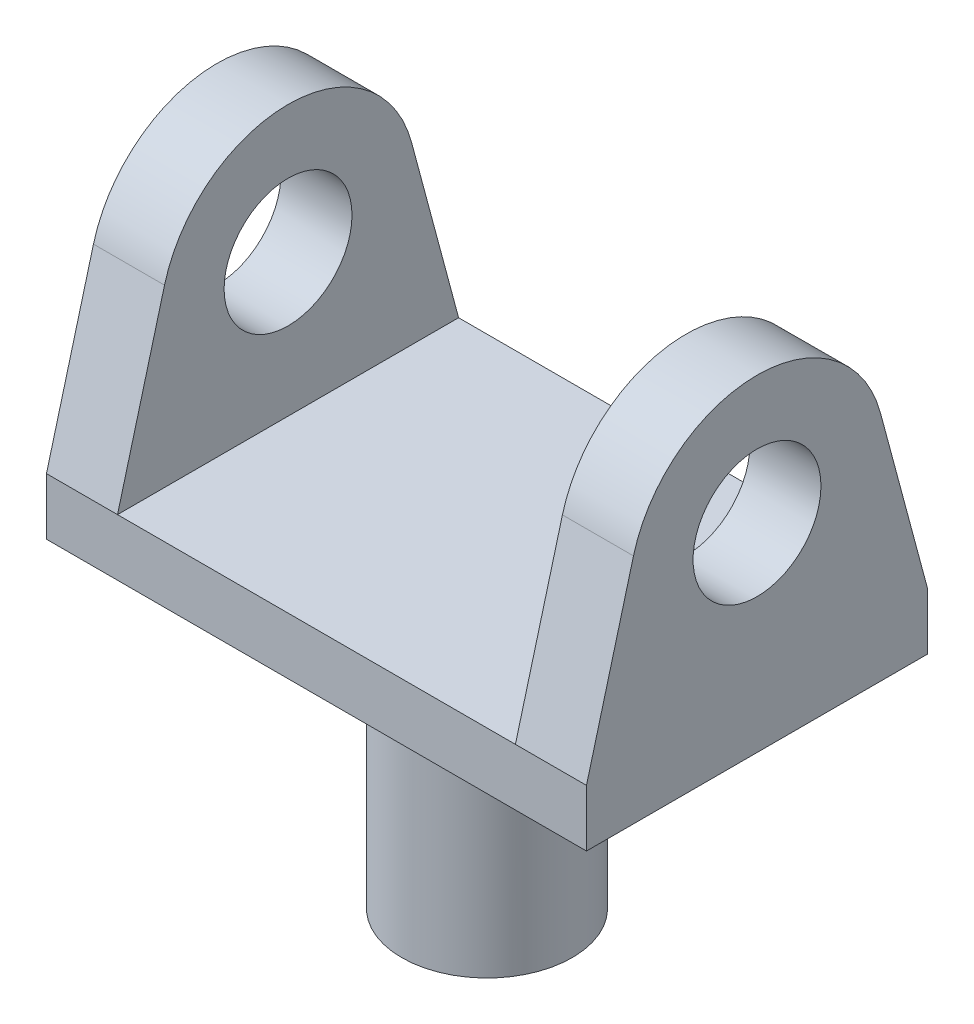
ISO-10303-21;
HEADER;
FILE_DESCRIPTION(('STEP AP214'),'2;1');
FILE_NAME('part.step','',(''),(''),'','','');
FILE_SCHEMA(('AUTOMOTIVE_DESIGN { 1 0 10303 214 1 1 1 1 }'));
ENDSEC;
DATA;
#1=APPLICATION_CONTEXT('core data for automotive mechanical design processes');
#2=APPLICATION_PROTOCOL_DEFINITION('international standard','automotive_design',2000,#1);
#3=PRODUCT_CONTEXT('',#1,'mechanical');
#4=PRODUCT('Part','Part','',(#3));
#5=PRODUCT_RELATED_PRODUCT_CATEGORY('part','',(#4));
#6=PRODUCT_DEFINITION_FORMATION('','',#4);
#7=PRODUCT_DEFINITION_CONTEXT('part definition',#1,'design');
#8=PRODUCT_DEFINITION('design','',#6,#7);
#9=PRODUCT_DEFINITION_SHAPE('','',#8);
#10=(LENGTH_UNIT() NAMED_UNIT(*) SI_UNIT(.MILLI.,.METRE.));
#11=(NAMED_UNIT(*) PLANE_ANGLE_UNIT() SI_UNIT($,.RADIAN.));
#12=(NAMED_UNIT(*) SI_UNIT($,.STERADIAN.) SOLID_ANGLE_UNIT());
#13=UNCERTAINTY_MEASURE_WITH_UNIT(LENGTH_MEASURE(1.E-05),#10,'distance_accuracy_value','');
#14=(GEOMETRIC_REPRESENTATION_CONTEXT(3) GLOBAL_UNCERTAINTY_ASSIGNED_CONTEXT((#13)) GLOBAL_UNIT_ASSIGNED_CONTEXT((#10,
#11,#12)) REPRESENTATION_CONTEXT('',''));
#15=CARTESIAN_POINT('',(0.,0.,0.));
#16=DIRECTION('',(0.,0.,1.));
#17=DIRECTION('',(1.,0.,0.));
#18=AXIS2_PLACEMENT_3D('',#15,#16,#17);
#19=CARTESIAN_POINT('',(-19.,0.,12.));
#20=DIRECTION('',(-1.,0.,0.));
#21=DIRECTION('',(0.,1.,0.));
#22=AXIS2_PLACEMENT_3D('',#19,#20,#21);
#23=PLANE('',#22);
#24=CARTESIAN_POINT('',(-19.,14.,0.));
#25=DIRECTION('',(-1.,0.,0.));
#26=DIRECTION('',(0.,0.,1.));
#27=AXIS2_PLACEMENT_3D('',#24,#25,#26);
#28=CIRCLE('',#27,4.49999999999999);
#29=CARTESIAN_POINT('',(-19.,14.,4.49999999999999));
#30=VERTEX_POINT('',#29);
#31=EDGE_CURVE('E576',#30,#30,#28,.T.);
#32=ORIENTED_EDGE('',*,*,#31,.F.);
#33=EDGE_LOOP('',(#32));
#34=FACE_BOUND('',#33,.T.);
#35=CARTESIAN_POINT('',(-19.,0.,-12.));
#36=DIRECTION('',(0.,0.,1.));
#37=VECTOR('',#36,1.);
#38=LINE('',#35,#37);
#39=CARTESIAN_POINT('',(-19.,0.,-12.));
#40=VERTEX_POINT('',#39);
#41=CARTESIAN_POINT('',(-19.,0.,12.));
#42=VERTEX_POINT('',#41);
#43=EDGE_CURVE('E72',#40,#42,#38,.T.);
#44=ORIENTED_EDGE('',*,*,#43,.T.);
#45=CARTESIAN_POINT('',(-19.,4.,12.));
#46=DIRECTION('',(0.,-1.,0.));
#47=VECTOR('',#46,1.);
#48=LINE('',#45,#47);
#49=CARTESIAN_POINT('',(-19.,4.,12.));
#50=VERTEX_POINT('',#49);
#51=EDGE_CURVE('E77',#50,#42,#48,.T.);
#52=ORIENTED_EDGE('',*,*,#51,.F.);
#53=CARTESIAN_POINT('',(-19.,4.,12.));
#54=CARTESIAN_POINT('',(-19.,8.11046766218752,10.8976583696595));
#55=CARTESIAN_POINT('',(-19.,12.220935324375,9.79531673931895));
#56=CARTESIAN_POINT('',(-19.,16.3313593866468,8.69279951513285));
#57=B_SPLINE_CURVE_WITH_KNOTS('',3,(#53,#54,#55,#56),.UNSPECIFIED.,.F.,.F.,(4,4),(0.,1.),.UNSPECIFIED.);
#58=CARTESIAN_POINT('',(-19.,16.3313593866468,8.69279951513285));
#59=VERTEX_POINT('',#58);
#60=EDGE_CURVE('E783',#50,#59,#57,.T.);
#61=ORIENTED_EDGE('',*,*,#60,.T.);
#62=CARTESIAN_POINT('',(-19.,16.3313593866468,8.69279951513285));
#63=CARTESIAN_POINT('',(-19.,17.6479375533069,8.33962774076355));
#64=CARTESIAN_POINT('',(-19.,18.866210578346,7.69298817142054));
#65=CARTESIAN_POINT('',(-19.,20.8933960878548,5.93501287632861));
#66=CARTESIAN_POINT('',(-19.,21.6884828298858,4.86106069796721));
#67=CARTESIAN_POINT('',(-19.,22.8316712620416,2.28885642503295));
#68=CARTESIAN_POINT('',(-19.,23.0886816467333,0.793849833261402));
#69=CARTESIAN_POINT('',(-19.,22.8339899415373,-2.4889749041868));
#70=CARTESIAN_POINT('',(-19.,22.1612563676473,-4.1980550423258));
#71=CARTESIAN_POINT('',(-19.,20.0448169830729,-6.8573004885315));
#72=CARTESIAN_POINT('',(-19.,18.7324851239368,-7.8209424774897));
#73=CARTESIAN_POINT('',(-19.,16.9416601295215,-8.5116101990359));
#74=CARTESIAN_POINT('',(-19.,16.6388058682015,-8.6103238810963));
#75=CARTESIAN_POINT('',(-19.,16.3313561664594,-8.6927869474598));
#76=CARTESIAN_POINT('',(-19.,16.3313560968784,-8.6927869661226));
#77=CARTESIAN_POINT('',(-19.,16.3313560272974,-8.6927869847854));
#78=B_SPLINE_CURVE_WITH_KNOTS('',3,(#62,#63,#64,#65,#66,#67,#68,#69,#70,#71,#72,#73,#74,#75,#76,
#77),.UNSPECIFIED.,.F.,.F.,(4,2,2,2,2,2,2,4),(0.,0.378446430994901,0.744922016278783,
1.15989795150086,1.65892575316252,2.10335627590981,2.19172800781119,2.19172802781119),.UNSPECIFIED.);
#79=CARTESIAN_POINT('',(-19.,16.3313560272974,-8.69278698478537));
#80=VERTEX_POINT('',#79);
#81=EDGE_CURVE('E788',#59,#80,#78,.T.);
#82=ORIENTED_EDGE('',*,*,#81,.T.);
#83=CARTESIAN_POINT('',(-19.,16.3313560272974,-8.6927869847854));
#84=CARTESIAN_POINT('',(-19.,12.2209123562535,-9.7952249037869));
#85=CARTESIAN_POINT('',(-19.,8.11045617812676,-10.8976124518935));
#86=CARTESIAN_POINT('',(-19.,4.,-12.));
#87=B_SPLINE_CURVE_WITH_KNOTS('',3,(#83,#84,#85,#86),.UNSPECIFIED.,.F.,.F.,(4,4),(0.,1.),.UNSPECIFIED.);
#88=CARTESIAN_POINT('',(-19.,4.,-12.));
#89=VERTEX_POINT('',#88);
#90=EDGE_CURVE('E793',#80,#89,#87,.T.);
#91=ORIENTED_EDGE('',*,*,#90,.T.);
#92=CARTESIAN_POINT('',(-19.,4.,-12.));
#93=DIRECTION('',(0.,-1.,0.));
#94=VECTOR('',#93,1.);
#95=LINE('',#92,#94);
#96=EDGE_CURVE('E458',#89,#40,#95,.T.);
#97=ORIENTED_EDGE('',*,*,#96,.T.);
#98=EDGE_LOOP('',(#44,#52,#61,#82,#91,#97));
#99=FACE_BOUND('',#98,.T.);
#100=ADVANCED_FACE('F53',(#34,#99),#23,.T.);
#101=CARTESIAN_POINT('',(-19.,0.,-12.));
#102=DIRECTION('',(0.,0.,-1.));
#103=DIRECTION('',(0.,1.,0.));
#104=AXIS2_PLACEMENT_3D('',#101,#102,#103);
#105=PLANE('',#104);
#106=CARTESIAN_POINT('',(19.,0.,-12.));
#107=DIRECTION('',(-1.,0.,0.));
#108=VECTOR('',#107,1.);
#109=LINE('',#106,#108);
#110=CARTESIAN_POINT('',(19.,0.,-12.));
#111=VERTEX_POINT('',#110);
#112=EDGE_CURVE('E464',#111,#40,#109,.T.);
#113=ORIENTED_EDGE('',*,*,#112,.T.);
#114=ORIENTED_EDGE('',*,*,#96,.F.);
#115=CARTESIAN_POINT('',(-14.,4.,-12.));
#116=DIRECTION('',(-1.,0.,0.));
#117=VECTOR('',#116,1.);
#118=LINE('',#115,#117);
#119=CARTESIAN_POINT('',(-13.9993291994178,4.,-12.));
#120=VERTEX_POINT('',#119);
#121=EDGE_CURVE('E449',#120,#89,#118,.T.);
#122=ORIENTED_EDGE('',*,*,#121,.F.);
#123=DIRECTION('',(1.,0.,0.));
#124=VECTOR('',#123,1.);
#125=CARTESIAN_POINT('',(14.,4.,-12.));
#126=LINE('',#125,#124);
#127=CARTESIAN_POINT('',(14.,4.,-12.));
#128=VERTEX_POINT('',#127);
#129=EDGE_CURVE('E457',#128,#120,#126,.F.);
#130=ORIENTED_EDGE('',*,*,#129,.F.);
#131=CARTESIAN_POINT('',(19.,4.00000000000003,-12.));
#132=DIRECTION('',(-1.,0.,0.));
#133=VECTOR('',#132,1.);
#134=LINE('',#131,#133);
#135=CARTESIAN_POINT('',(19.,3.99999999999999,-12.));
#136=VERTEX_POINT('',#135);
#137=EDGE_CURVE('E465',#136,#128,#134,.T.);
#138=ORIENTED_EDGE('',*,*,#137,.F.);
#139=CARTESIAN_POINT('',(19.,3.99999999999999,-12.));
#140=DIRECTION('',(0.,-1.,0.));
#141=VECTOR('',#140,1.);
#142=LINE('',#139,#141);
#143=EDGE_CURVE('E470',#136,#111,#142,.T.);
#144=ORIENTED_EDGE('',*,*,#143,.T.);
#145=EDGE_LOOP('',(#113,#114,#122,#130,#138,#144));
#146=FACE_BOUND('',#145,.T.);
#147=ADVANCED_FACE('F416',(#146),#105,.T.);
#148=CARTESIAN_POINT('',(19.,0.,-12.));
#149=DIRECTION('',(1.,0.,0.));
#150=DIRECTION('',(0.,1.,0.));
#151=AXIS2_PLACEMENT_3D('',#148,#149,#150);
#152=PLANE('',#151);
#153=CARTESIAN_POINT('',(19.,14.,0.));
#154=DIRECTION('',(1.,0.,0.));
#155=DIRECTION('',(0.,0.,-1.));
#156=AXIS2_PLACEMENT_3D('',#153,#154,#155);
#157=CIRCLE('',#156,4.49999999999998);
#158=CARTESIAN_POINT('',(19.,14.,-4.49999999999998));
#159=VERTEX_POINT('',#158);
#160=EDGE_CURVE('E569',#159,#159,#157,.T.);
#161=ORIENTED_EDGE('',*,*,#160,.F.);
#162=EDGE_LOOP('',(#161));
#163=FACE_BOUND('',#162,.T.);
#164=CARTESIAN_POINT('',(19.,0.,12.));
#165=DIRECTION('',(0.,0.,-1.));
#166=VECTOR('',#165,1.);
#167=LINE('',#164,#166);
#168=CARTESIAN_POINT('',(19.,0.,12.));
#169=VERTEX_POINT('',#168);
#170=EDGE_CURVE('E475',#169,#111,#167,.T.);
#171=ORIENTED_EDGE('',*,*,#170,.T.);
#172=ORIENTED_EDGE('',*,*,#143,.F.);
#173=CARTESIAN_POINT('',(19.,16.331359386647,-8.69279951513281));
#174=DIRECTION('',(0.,-0.965866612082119,-0.259039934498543));
#175=VECTOR('',#174,1.);
#176=LINE('',#173,#175);
#177=CARTESIAN_POINT('',(19.,16.3313476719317,-8.69275583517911));
#178=VERTEX_POINT('',#177);
#179=EDGE_CURVE('E481',#178,#136,#176,.T.);
#180=ORIENTED_EDGE('',*,*,#179,.F.);
#181=CARTESIAN_POINT('',(19.,14.,0.));
#182=DIRECTION('',(-1.,0.,0.));
#183=DIRECTION('',(0.,0.25903993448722,0.965866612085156));
#184=AXIS2_PLACEMENT_3D('',#181,#182,#183);
#185=CIRCLE('',#184,9.);
#186=CARTESIAN_POINT('',(19.,16.3313560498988,8.69278697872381));
#187=VERTEX_POINT('',#186);
#188=EDGE_CURVE('E488',#187,#178,#185,.T.);
#189=ORIENTED_EDGE('',*,*,#188,.F.);
#190=CARTESIAN_POINT('',(19.,4.,12.));
#191=DIRECTION('',(0.,0.965866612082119,-0.259039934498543));
#192=VECTOR('',#191,1.);
#193=LINE('',#190,#192);
#194=CARTESIAN_POINT('',(19.,4.,12.));
#195=VERTEX_POINT('',#194);
#196=EDGE_CURVE('E166',#195,#187,#193,.T.);
#197=ORIENTED_EDGE('',*,*,#196,.F.);
#198=CARTESIAN_POINT('',(19.,4.,12.));
#199=DIRECTION('',(0.,-1.,0.));
#200=VECTOR('',#199,1.);
#201=LINE('',#198,#200);
#202=EDGE_CURVE('E146',#195,#169,#201,.T.);
#203=ORIENTED_EDGE('',*,*,#202,.T.);
#204=EDGE_LOOP('',(#171,#172,#180,#189,#197,#203));
#205=FACE_BOUND('',#204,.T.);
#206=ADVANCED_FACE('F345',(#163,#205),#152,.T.);
#207=CARTESIAN_POINT('',(14.,16.3313593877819,-8.69279951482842));
#208=DIRECTION('',(0.,0.259039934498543,-0.965866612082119));
#209=DIRECTION('',(1.,0.,0.));
#210=AXIS2_PLACEMENT_3D('',#207,#208,#209);
#211=PLANE('',#210);
#212=ORIENTED_EDGE('',*,*,#179,.T.);
#213=ORIENTED_EDGE('',*,*,#137,.T.);
#214=DIRECTION('',(0.,-0.965866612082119,-0.259039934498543));
#215=VECTOR('',#214,1.);
#216=CARTESIAN_POINT('',(14.,16.3313593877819,-8.69279951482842));
#217=LINE('',#216,#215);
#218=CARTESIAN_POINT('',(14.,16.3313577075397,-8.69279324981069));
#219=VERTEX_POINT('',#218);
#220=EDGE_CURVE('E161',#219,#128,#217,.T.);
#221=ORIENTED_EDGE('',*,*,#220,.F.);
#222=CARTESIAN_POINT('',(14.,16.3313593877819,-8.69279951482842));
#223=DIRECTION('',(1.,-2.26989260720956E-10,-6.08773448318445E-11));
#224=VECTOR('',#223,1.);
#225=LINE('',#222,#224);
#226=EDGE_CURVE('E158',#219,#178,#225,.T.);
#227=ORIENTED_EDGE('',*,*,#226,.T.);
#228=EDGE_LOOP('',(#212,#213,#221,#227));
#229=FACE_BOUND('',#228,.T.);
#230=ADVANCED_FACE('F336',(#229),#211,.T.);
#231=CARTESIAN_POINT('',(14.,14.,0.));
#232=DIRECTION('',(1.,0.,0.));
#233=DIRECTION('',(0.,-1.,-1.21047616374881E-12));
#234=AXIS2_PLACEMENT_3D('',#231,#232,#233);
#235=CYLINDRICAL_SURFACE('',#234,9.);
#236=ORIENTED_EDGE('',*,*,#188,.T.);
#237=ORIENTED_EDGE('',*,*,#226,.F.);
#238=CARTESIAN_POINT('',(14.,16.3313577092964,8.69275314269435));
#239=CARTESIAN_POINT('',(14.,17.0456512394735,8.50114444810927));
#240=CARTESIAN_POINT('',(14.,17.7180889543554,8.19613455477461));
#241=CARTESIAN_POINT('',(14.,18.3897938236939,7.89145707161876));
#242=CARTESIAN_POINT('',(14.,19.0019164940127,7.48219224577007));
#243=CARTESIAN_POINT('',(14.,19.6173043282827,7.07074433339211));
#244=CARTESIAN_POINT('',(14.,20.1566180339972,6.56484269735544));
#245=CARTESIAN_POINT('',(14.,20.6955930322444,6.05925878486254));
#246=CARTESIAN_POINT('',(14.,21.1443954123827,5.47333889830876));
#247=CARTESIAN_POINT('',(14.,21.593536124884,4.88697731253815));
#248=CARTESIAN_POINT('',(14.,21.9406542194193,4.23631689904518));
#249=CARTESIAN_POINT('',(14.,22.2893333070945,3.58273045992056));
#250=CARTESIAN_POINT('',(14.,22.5261348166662,2.88216031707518));
#251=CARTESIAN_POINT('',(14.,22.7621884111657,2.18380285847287));
#252=CARTESIAN_POINT('',(14.,22.881321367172,1.45733652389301));
#253=CARTESIAN_POINT('',(14.,23.0006506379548,0.729673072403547));
#254=CARTESIAN_POINT('',(14.,23.0000288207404,-0.00683783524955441));
#255=CARTESIAN_POINT('',(14.,22.9994034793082,-0.747522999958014));
#256=CARTESIAN_POINT('',(14.,22.8781112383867,-1.47664827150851));
#257=CARTESIAN_POINT('',(14.,22.7573671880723,-2.20247819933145));
#258=CARTESIAN_POINT('',(14.,22.5206739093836,-2.89813727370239));
#259=CARTESIAN_POINT('',(14.,22.2841117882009,-3.59341086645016));
#260=CARTESIAN_POINT('',(14.,21.9384985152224,-4.24028031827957));
#261=CARTESIAN_POINT('',(14.,21.5908058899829,-4.89104160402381));
#262=CARTESIAN_POINT('',(14.,21.1423759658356,-5.47586991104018));
#263=CARTESIAN_POINT('',(14.,20.6922128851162,-6.06295854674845));
#264=CARTESIAN_POINT('',(14.,20.1533797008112,-6.56778804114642));
#265=CARTESIAN_POINT('',(14.,19.6162425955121,-7.07102848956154));
#266=CARTESIAN_POINT('',(14.,19.0054244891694,-7.47973512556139));
#267=CARTESIAN_POINT('',(14.,18.392625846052,-7.88976696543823));
#268=CARTESIAN_POINT('',(14.,17.7221652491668,-8.19423422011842));
#269=CARTESIAN_POINT('',(14.,17.0469882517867,-8.50084327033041));
#270=CARTESIAN_POINT('',(14.,16.3313560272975,-8.69278698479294));
#271=B_SPLINE_CURVE_WITH_KNOTS('',2,(#238,#239,#240,#241,#242,#243,#244,#245,#246,#247,#248,
#249,#250,#251,#252,#253,#254,#255,#256,#257,#258,#259,#260,#261,#262,#263,#264,#265,#266,#267,
#268,#269,#270),.UNSPECIFIED.,.F.,.F.,(3,2,2,2,2,2,2,2,2,2,2,2,2,2,2,2,3),(0.,0.0625,0.125,
0.1875,0.25,0.3125,0.375,0.4375,0.5,0.5625,0.625,0.6875,0.75,0.8125,0.875,0.9375,1.),.UNSPECIFIED.);
#272=CARTESIAN_POINT('',(14.,16.3313577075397,8.69277655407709));
#273=VERTEX_POINT('',#272);
#274=EDGE_CURVE('E138',#273,#219,#271,.T.);
#275=ORIENTED_EDGE('',*,*,#274,.F.);
#276=CARTESIAN_POINT('',(14.,16.3313593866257,8.6927995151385));
#277=CARTESIAN_POINT('',(14.2083333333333,16.3313593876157,8.692799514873));
#278=CARTESIAN_POINT('',(14.4166666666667,16.3313593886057,8.69279951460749));
#279=CARTESIAN_POINT('',(14.8333333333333,16.3313593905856,8.69279951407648));
#280=CARTESIAN_POINT('',(15.0416666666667,16.3313593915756,8.69279951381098));
#281=CARTESIAN_POINT('',(15.4583333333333,16.3313593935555,8.69279951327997));
#282=CARTESIAN_POINT('',(15.6666666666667,16.3313593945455,8.69279951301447));
#283=CARTESIAN_POINT('',(16.0833333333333,16.3313593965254,8.69279951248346));
#284=CARTESIAN_POINT('',(16.2916666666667,16.3313593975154,8.69279951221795));
#285=CARTESIAN_POINT('',(16.7083333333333,16.3313593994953,8.69279951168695));
#286=CARTESIAN_POINT('',(16.9166666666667,16.3313594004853,8.69279951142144));
#287=CARTESIAN_POINT('',(17.3333333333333,16.3313594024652,8.69279951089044));
#288=CARTESIAN_POINT('',(17.5416666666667,16.3313594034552,8.69279951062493));
#289=CARTESIAN_POINT('',(17.9583333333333,16.3313594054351,8.69279951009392));
#290=CARTESIAN_POINT('',(18.1666666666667,16.3313594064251,8.69279950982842));
#291=CARTESIAN_POINT('',(18.5833333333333,16.331359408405,8.69279950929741));
#292=CARTESIAN_POINT('',(18.7916666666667,16.331359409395,8.69279950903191));
#293=CARTESIAN_POINT('',(19.,16.331359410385,8.6927995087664));
#294=B_SPLINE_CURVE_WITH_KNOTS('',3,(#276,#277,#278,#279,#280,#281,#282,#283,#284,#285,#286,
#287,#288,#289,#290,#291,#292,#293),.UNSPECIFIED.,.F.,.F.,(4,2,2,2,2,2,2,2,4),(0.,
0.625000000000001,1.25,1.875,2.5,3.125,3.75,4.375,5.),.UNSPECIFIED.);
#295=EDGE_CURVE('E154',#273,#187,#294,.T.);
#296=ORIENTED_EDGE('',*,*,#295,.T.);
#297=EDGE_LOOP('',(#236,#237,#275,#296));
#298=FACE_BOUND('',#297,.T.);
#299=ADVANCED_FACE('F153',(#298),#235,.T.);
#300=CARTESIAN_POINT('',(14.,4.,12.));
#301=DIRECTION('',(0.,0.259039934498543,0.965866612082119));
#302=DIRECTION('',(1.,0.,0.));
#303=AXIS2_PLACEMENT_3D('',#300,#301,#302);
#304=PLANE('',#303);
#305=ORIENTED_EDGE('',*,*,#196,.T.);
#306=ORIENTED_EDGE('',*,*,#295,.F.);
#307=DIRECTION('',(0.,0.965866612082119,-0.259039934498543));
#308=VECTOR('',#307,1.);
#309=CARTESIAN_POINT('',(14.,4.,12.));
#310=LINE('',#309,#308);
#311=CARTESIAN_POINT('',(13.9993535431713,4.,12.));
#312=VERTEX_POINT('',#311);
#313=EDGE_CURVE('E134',#312,#273,#310,.T.);
#314=ORIENTED_EDGE('',*,*,#313,.F.);
#315=CARTESIAN_POINT('',(14.,4.,12.));
#316=DIRECTION('',(1.,0.,0.));
#317=VECTOR('',#316,1.);
#318=LINE('',#315,#317);
#319=EDGE_CURVE('E169',#312,#195,#318,.T.);
#320=ORIENTED_EDGE('',*,*,#319,.T.);
#321=EDGE_LOOP('',(#305,#306,#314,#320));
#322=FACE_BOUND('',#321,.T.);
#323=ADVANCED_FACE('F165',(#322),#304,.T.);
#324=CARTESIAN_POINT('',(19.,0.,12.));
#325=DIRECTION('',(0.,0.,1.));
#326=DIRECTION('',(0.,1.,0.));
#327=AXIS2_PLACEMENT_3D('',#324,#325,#326);
#328=PLANE('',#327);
#329=CARTESIAN_POINT('',(-19.,0.,12.));
#330=DIRECTION('',(1.,0.,0.));
#331=VECTOR('',#330,1.);
#332=LINE('',#329,#331);
#333=EDGE_CURVE('E505',#42,#169,#332,.T.);
#334=ORIENTED_EDGE('',*,*,#333,.T.);
#335=ORIENTED_EDGE('',*,*,#202,.F.);
#336=ORIENTED_EDGE('',*,*,#319,.F.);
#337=DIRECTION('',(-1.,0.,0.));
#338=VECTOR('',#337,1.);
#339=CARTESIAN_POINT('',(19.,4.,12.));
#340=LINE('',#339,#338);
#341=CARTESIAN_POINT('',(-14.,4.,12.));
#342=VERTEX_POINT('',#341);
#343=EDGE_CURVE('E64',#312,#342,#340,.T.);
#344=ORIENTED_EDGE('',*,*,#343,.T.);
#345=CARTESIAN_POINT('',(-19.,4.00000000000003,12.));
#346=DIRECTION('',(1.,0.,0.));
#347=VECTOR('',#346,1.);
#348=LINE('',#345,#347);
#349=EDGE_CURVE('E510',#50,#342,#348,.T.);
#350=ORIENTED_EDGE('',*,*,#349,.F.);
#351=ORIENTED_EDGE('',*,*,#51,.T.);
#352=EDGE_LOOP('',(#334,#335,#336,#344,#350,#351));
#353=FACE_BOUND('',#352,.T.);
#354=ADVANCED_FACE('F190',(#353),#328,.T.);
#355=CARTESIAN_POINT('',(-19.,16.3313593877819,8.69279951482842));
#356=DIRECTION('',(0.,0.259039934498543,0.965866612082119));
#357=DIRECTION('',(0.,-0.965866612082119,0.259039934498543));
#358=AXIS2_PLACEMENT_3D('',#355,#356,#357);
#359=PLANE('',#358);
#360=ORIENTED_EDGE('',*,*,#60,.F.);
#361=ORIENTED_EDGE('',*,*,#349,.T.);
#362=DIRECTION('',(0.,-0.965866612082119,0.259039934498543));
#363=VECTOR('',#362,1.);
#364=CARTESIAN_POINT('',(-14.,16.3313593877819,8.69279951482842));
#365=LINE('',#364,#363);
#366=CARTESIAN_POINT('',(-14.,16.3313560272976,8.69277689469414));
#367=VERTEX_POINT('',#366);
#368=EDGE_CURVE('E769',#342,#367,#365,.F.);
#369=ORIENTED_EDGE('',*,*,#368,.T.);
#370=CARTESIAN_POINT('',(-14.,16.3313593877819,8.69279951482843));
#371=DIRECTION('',(-1.,-2.27014240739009E-10,6.08839367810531E-11));
#372=VECTOR('',#371,1.);
#373=LINE('',#370,#372);
#374=EDGE_CURVE('E842',#367,#59,#373,.T.);
#375=ORIENTED_EDGE('',*,*,#374,.T.);
#376=EDGE_LOOP('',(#360,#361,#369,#375));
#377=FACE_BOUND('',#376,.T.);
#378=ADVANCED_FACE('F230',(#377),#359,.T.);
#379=CARTESIAN_POINT('',(-14.,14.,0.));
#380=DIRECTION('',(-1.,0.,0.));
#381=DIRECTION('',(0.,-1.,1.20997656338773E-12));
#382=AXIS2_PLACEMENT_3D('',#379,#380,#381);
#383=CYLINDRICAL_SURFACE('',#382,9.);
#384=ORIENTED_EDGE('',*,*,#81,.F.);
#385=ORIENTED_EDGE('',*,*,#374,.F.);
#386=CARTESIAN_POINT('',(-14.,14.,0.));
#387=DIRECTION('',(-1.,0.,0.));
#388=DIRECTION('',(0.,0.259039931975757,0.965866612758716));
#389=AXIS2_PLACEMENT_3D('',#386,#387,#388);
#390=CIRCLE('',#389,9.);
#391=CARTESIAN_POINT('',(-14.,16.3313560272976,-8.69279370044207));
#392=VERTEX_POINT('',#391);
#393=EDGE_CURVE('E589',#367,#392,#390,.T.);
#394=ORIENTED_EDGE('',*,*,#393,.T.);
#395=CARTESIAN_POINT('',(-14.,16.3313593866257,-8.69279951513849));
#396=CARTESIAN_POINT('',(-14.2083333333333,16.331359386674,-8.69279951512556));
#397=CARTESIAN_POINT('',(-14.4166666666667,16.3313593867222,-8.69279951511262));
#398=CARTESIAN_POINT('',(-14.8333333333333,16.3313593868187,-8.69279951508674));
#399=CARTESIAN_POINT('',(-15.0416666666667,16.3313593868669,-8.6927995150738));
#400=CARTESIAN_POINT('',(-15.4583333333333,16.3313593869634,-8.69279951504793));
#401=CARTESIAN_POINT('',(-15.6666666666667,16.3313593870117,-8.69279951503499));
#402=CARTESIAN_POINT('',(-16.0833333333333,16.3313593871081,-8.69279951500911));
#403=CARTESIAN_POINT('',(-16.2916666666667,16.3313593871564,-8.69279951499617));
#404=CARTESIAN_POINT('',(-16.7083333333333,16.3313593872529,-8.6927995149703));
#405=CARTESIAN_POINT('',(-16.9166666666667,16.3313593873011,-8.69279951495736));
#406=CARTESIAN_POINT('',(-17.3333333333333,16.3313593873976,-8.69279951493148));
#407=CARTESIAN_POINT('',(-17.5416666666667,16.3313593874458,-8.69279951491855));
#408=CARTESIAN_POINT('',(-17.9583333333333,16.3313593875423,-8.69279951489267));
#409=CARTESIAN_POINT('',(-18.1666666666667,16.3313593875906,-8.69279951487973));
#410=CARTESIAN_POINT('',(-18.5833333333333,16.331359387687,-8.69279951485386));
#411=CARTESIAN_POINT('',(-18.7916666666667,16.3313593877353,-8.69279951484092));
#412=CARTESIAN_POINT('',(-19.,16.3313593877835,-8.69279951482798));
#413=B_SPLINE_CURVE_WITH_KNOTS('',3,(#395,#396,#397,#398,#399,#400,#401,#402,#403,#404,#405,
#406,#407,#408,#409,#410,#411,#412),.UNSPECIFIED.,.F.,.F.,(4,2,2,2,2,2,2,2,4),(0.,
0.624999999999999,1.25,1.875,2.5,3.125,3.75,4.375,5.),.UNSPECIFIED.);
#414=EDGE_CURVE('E847',#392,#80,#413,.T.);
#415=ORIENTED_EDGE('',*,*,#414,.T.);
#416=EDGE_LOOP('',(#384,#385,#394,#415));
#417=FACE_BOUND('',#416,.T.);
#418=ADVANCED_FACE('F239',(#417),#383,.T.);
#419=CARTESIAN_POINT('',(-19.,4.,-12.));
#420=DIRECTION('',(0.,0.259039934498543,-0.965866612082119));
#421=DIRECTION('',(0.,0.965866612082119,0.259039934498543));
#422=AXIS2_PLACEMENT_3D('',#419,#420,#421);
#423=PLANE('',#422);
#424=ORIENTED_EDGE('',*,*,#90,.F.);
#425=ORIENTED_EDGE('',*,*,#414,.F.);
#426=DIRECTION('',(0.,0.965866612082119,0.259039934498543));
#427=VECTOR('',#426,1.);
#428=CARTESIAN_POINT('',(-14.,4.,-12.));
#429=LINE('',#428,#427);
#430=EDGE_CURVE('E758',#392,#120,#429,.F.);
#431=ORIENTED_EDGE('',*,*,#430,.T.);
#432=ORIENTED_EDGE('',*,*,#121,.T.);
#433=EDGE_LOOP('',(#424,#425,#431,#432));
#434=FACE_BOUND('',#433,.T.);
#435=ADVANCED_FACE('F531',(#434),#423,.T.);
#436=CARTESIAN_POINT('',(-19.,0.,-12.));
#437=DIRECTION('',(0.,-1.,0.));
#438=DIRECTION('',(1.,0.,0.));
#439=AXIS2_PLACEMENT_3D('',#436,#437,#438);
#440=PLANE('',#439);
#441=CARTESIAN_POINT('',(0.,0.,0.));
#442=DIRECTION('',(0.,-1.,0.));
#443=DIRECTION('',(0.,0.,-1.));
#444=AXIS2_PLACEMENT_3D('',#441,#442,#443);
#445=CIRCLE('',#444,6.);
#446=CARTESIAN_POINT('',(0.,0.,-6.));
#447=VERTEX_POINT('',#446);
#448=EDGE_CURVE('E13',#447,#447,#445,.T.);
#449=ORIENTED_EDGE('',*,*,#448,.F.);
#450=EDGE_LOOP('',(#449));
#451=FACE_BOUND('',#450,.T.);
#452=ORIENTED_EDGE('',*,*,#43,.F.);
#453=ORIENTED_EDGE('',*,*,#112,.F.);
#454=ORIENTED_EDGE('',*,*,#170,.F.);
#455=ORIENTED_EDGE('',*,*,#333,.F.);
#456=EDGE_LOOP('',(#452,#453,#454,#455));
#457=FACE_BOUND('',#456,.T.);
#458=ADVANCED_FACE('F512',(#451,#457),#440,.T.);
#459=CARTESIAN_POINT('',(14.,4.,-12.));
#460=DIRECTION('',(0.,-1.,0.));
#461=DIRECTION('',(0.,0.,-1.));
#462=AXIS2_PLACEMENT_3D('',#459,#460,#461);
#463=PLANE('',#462);
#464=CARTESIAN_POINT('',(-14.,4.,-12.));
#465=CARTESIAN_POINT('',(-14.,4.,-4.));
#466=CARTESIAN_POINT('',(-14.,4.,4.));
#467=CARTESIAN_POINT('',(-14.,4.,12.));
#468=B_SPLINE_CURVE_WITH_KNOTS('',3,(#464,#465,#466,#467),.UNSPECIFIED.,.F.,.F.,(4,4),(0.,1.),.UNSPECIFIED.);
#469=EDGE_CURVE('E554',#120,#342,#468,.T.);
#470=ORIENTED_EDGE('',*,*,#469,.T.);
#471=ORIENTED_EDGE('',*,*,#343,.F.);
#472=CARTESIAN_POINT('',(14.,4.,-12.));
#473=CARTESIAN_POINT('',(14.,4.,-4.));
#474=CARTESIAN_POINT('',(14.,4.,4.));
#475=CARTESIAN_POINT('',(14.,4.,12.));
#476=B_SPLINE_CURVE_WITH_KNOTS('',3,(#472,#473,#474,#475),.UNSPECIFIED.,.F.,.F.,(4,4),(0.,1.),.UNSPECIFIED.);
#477=EDGE_CURVE('E140',#128,#312,#476,.T.);
#478=ORIENTED_EDGE('',*,*,#477,.F.);
#479=ORIENTED_EDGE('',*,*,#129,.T.);
#480=EDGE_LOOP('',(#470,#471,#478,#479));
#481=FACE_BOUND('',#480,.T.);
#482=ADVANCED_FACE('F530',(#481),#463,.F.);
#483=CARTESIAN_POINT('',(14.,10.1656852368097,10.3464450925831));
#484=DIRECTION('',(1.,0.,0.));
#485=DIRECTION('',(0.,0.,-1.));
#486=AXIS2_PLACEMENT_3D('',#483,#484,#485);
#487=PLANE('',#486);
#488=CARTESIAN_POINT('',(14.,14.,0.));
#489=DIRECTION('',(1.,0.,0.));
#490=DIRECTION('',(0.,0.,-1.));
#491=AXIS2_PLACEMENT_3D('',#488,#489,#490);
#492=CIRCLE('',#491,4.49999999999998);
#493=CARTESIAN_POINT('',(14.,14.,-4.49999999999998));
#494=VERTEX_POINT('',#493);
#495=EDGE_CURVE('E572',#494,#494,#492,.T.);
#496=ORIENTED_EDGE('',*,*,#495,.T.);
#497=EDGE_LOOP('',(#496));
#498=FACE_BOUND('',#497,.T.);
#499=ORIENTED_EDGE('',*,*,#313,.T.);
#500=ORIENTED_EDGE('',*,*,#274,.T.);
#501=ORIENTED_EDGE('',*,*,#220,.T.);
#502=ORIENTED_EDGE('',*,*,#477,.T.);
#503=EDGE_LOOP('',(#499,#500,#501,#502));
#504=FACE_BOUND('',#503,.T.);
#505=ADVANCED_FACE('F136',(#498,#504),#487,.F.);
#506=CARTESIAN_POINT('',(-14.,10.1656852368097,10.3464450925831));
#507=DIRECTION('',(1.,0.,0.));
#508=DIRECTION('',(0.,0.,-1.));
#509=AXIS2_PLACEMENT_3D('',#506,#507,#508);
#510=PLANE('',#509);
#511=CARTESIAN_POINT('',(-14.,14.,0.));
#512=DIRECTION('',(1.,0.,0.));
#513=DIRECTION('',(0.,0.,-1.));
#514=AXIS2_PLACEMENT_3D('',#511,#512,#513);
#515=CIRCLE('',#514,4.49999999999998);
#516=CARTESIAN_POINT('',(-14.,14.,-4.49999999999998));
#517=VERTEX_POINT('',#516);
#518=EDGE_CURVE('E575',#517,#517,#515,.T.);
#519=ORIENTED_EDGE('',*,*,#518,.F.);
#520=EDGE_LOOP('',(#519));
#521=FACE_BOUND('',#520,.T.);
#522=ORIENTED_EDGE('',*,*,#430,.F.);
#523=ORIENTED_EDGE('',*,*,#393,.F.);
#524=ORIENTED_EDGE('',*,*,#368,.F.);
#525=ORIENTED_EDGE('',*,*,#469,.F.);
#526=EDGE_LOOP('',(#522,#523,#524,#525));
#527=FACE_BOUND('',#526,.T.);
#528=ADVANCED_FACE('F593',(#521,#527),#510,.T.);
#529=CARTESIAN_POINT('',(0.,-19.0026983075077,0.));
#530=DIRECTION('',(0.,1.,0.));
#531=DIRECTION('',(0.,0.,1.));
#532=AXIS2_PLACEMENT_3D('',#529,#530,#531);
#533=CYLINDRICAL_SURFACE('',#532,6.);
#534=CARTESIAN_POINT('',(0.,-19.,0.));
#535=DIRECTION('',(0.,1.,0.));
#536=DIRECTION('',(0.,0.,1.));
#537=AXIS2_PLACEMENT_3D('',#534,#535,#536);
#538=CIRCLE('',#537,6.);
#539=CARTESIAN_POINT('',(0.,-19.,6.));
#540=VERTEX_POINT('',#539);
#541=EDGE_CURVE('E560',#540,#540,#538,.T.);
#542=ORIENTED_EDGE('',*,*,#541,.T.);
#543=EDGE_LOOP('',(#542));
#544=FACE_BOUND('',#543,.T.);
#545=ORIENTED_EDGE('',*,*,#448,.T.);
#546=EDGE_LOOP('',(#545));
#547=FACE_BOUND('',#546,.T.);
#548=ADVANCED_FACE('F601',(#544,#547),#533,.T.);
#549=CARTESIAN_POINT('',(6.,-19.,0.));
#550=DIRECTION('',(0.,-1.,0.));
#551=DIRECTION('',(0.,0.,-1.));
#552=AXIS2_PLACEMENT_3D('',#549,#550,#551);
#553=PLANE('',#552);
#554=CARTESIAN_POINT('',(0.,-19.,0.311891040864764));
#555=DIRECTION('',(0.,-1.,0.));
#556=DIRECTION('',(0.,0.,-1.));
#557=AXIS2_PLACEMENT_3D('',#554,#555,#556);
#558=CIRCLE('',#557,3.);
#559=CARTESIAN_POINT('',(0.,-19.,-2.68810895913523));
#560=VERTEX_POINT('',#559);
#561=EDGE_CURVE('E566',#560,#560,#558,.T.);
#562=ORIENTED_EDGE('',*,*,#561,.F.);
#563=EDGE_LOOP('',(#562));
#564=FACE_BOUND('',#563,.T.);
#565=ORIENTED_EDGE('',*,*,#541,.F.);
#566=EDGE_LOOP('',(#565));
#567=FACE_BOUND('',#566,.T.);
#568=ADVANCED_FACE('F609',(#564,#567),#553,.T.);
#569=CARTESIAN_POINT('',(0.,0.,0.311891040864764));
#570=DIRECTION('',(0.,1.,0.));
#571=DIRECTION('',(0.,0.,1.));
#572=AXIS2_PLACEMENT_3D('',#569,#570,#571);
#573=PLANE('',#572);
#574=CARTESIAN_POINT('',(0.,0.,0.311891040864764));
#575=DIRECTION('',(0.,-1.,0.));
#576=DIRECTION('',(0.,0.,-1.));
#577=AXIS2_PLACEMENT_3D('',#574,#575,#576);
#578=CIRCLE('',#577,3.);
#579=CARTESIAN_POINT('',(0.,0.,-2.68810895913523));
#580=VERTEX_POINT('',#579);
#581=EDGE_CURVE('E563',#580,#580,#578,.T.);
#582=ORIENTED_EDGE('',*,*,#581,.T.);
#583=EDGE_LOOP('',(#582));
#584=FACE_BOUND('',#583,.T.);
#585=ADVANCED_FACE('F613',(#584),#573,.F.);
#586=CARTESIAN_POINT('',(0.,-19.,0.311891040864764));
#587=DIRECTION('',(0.,-1.,0.));
#588=DIRECTION('',(0.,0.,-1.));
#589=AXIS2_PLACEMENT_3D('',#586,#587,#588);
#590=CYLINDRICAL_SURFACE('',#589,3.);
#591=ORIENTED_EDGE('',*,*,#581,.F.);
#592=EDGE_LOOP('',(#591));
#593=FACE_BOUND('',#592,.T.);
#594=ORIENTED_EDGE('',*,*,#561,.T.);
#595=EDGE_LOOP('',(#594));
#596=FACE_BOUND('',#595,.T.);
#597=ADVANCED_FACE('F617',(#593,#596),#590,.F.);
#598=CARTESIAN_POINT('',(-19.,14.,0.));
#599=DIRECTION('',(-1.,0.,0.));
#600=DIRECTION('',(0.,0.,1.));
#601=AXIS2_PLACEMENT_3D('',#598,#599,#600);
#602=CYLINDRICAL_SURFACE('',#601,4.49999999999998);
#603=ORIENTED_EDGE('',*,*,#518,.T.);
#604=EDGE_LOOP('',(#603));
#605=FACE_BOUND('',#604,.T.);
#606=ORIENTED_EDGE('',*,*,#31,.T.);
#607=EDGE_LOOP('',(#606));
#608=FACE_BOUND('',#607,.T.);
#609=ADVANCED_FACE('F621',(#605,#608),#602,.F.);
#610=ORIENTED_EDGE('',*,*,#160,.T.);
#611=EDGE_LOOP('',(#610));
#612=FACE_BOUND('',#611,.T.);
#613=ORIENTED_EDGE('',*,*,#495,.F.);
#614=EDGE_LOOP('',(#613));
#615=FACE_BOUND('',#614,.T.);
#616=ADVANCED_FACE('F624',(#612,#615),#602,.F.);
#617=CLOSED_SHELL('',(#100,#147,#206,#230,#299,#323,#354,#378,#418,#435,#458,#482,#505,#528,
#548,#568,#585,#597,#609,#616));
#618=MANIFOLD_SOLID_BREP('B2',#617);
#619=ADVANCED_BREP_SHAPE_REPRESENTATION('',(#18,#618),#14);
#620=SHAPE_DEFINITION_REPRESENTATION(#9,#619);
ENDSEC;
END-ISO-10303-21;
